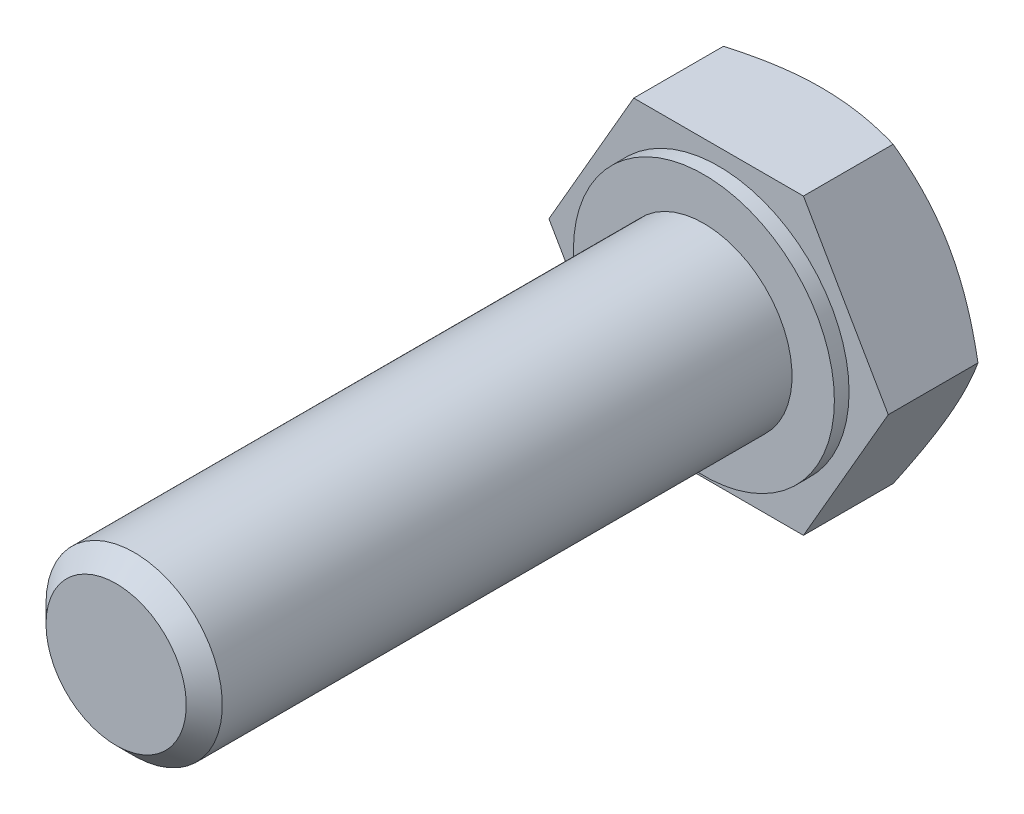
ISO-10303-21;
HEADER;
FILE_DESCRIPTION(('STEP AP214'),'2;1');
FILE_NAME('part.step','',(''),(''),'','','');
FILE_SCHEMA(('AUTOMOTIVE_DESIGN { 1 0 10303 214 1 1 1 1 }'));
ENDSEC;
DATA;
#1=APPLICATION_CONTEXT('core data for automotive mechanical design processes');
#2=APPLICATION_PROTOCOL_DEFINITION('international standard','automotive_design',2000,#1);
#3=PRODUCT_CONTEXT('',#1,'mechanical');
#4=PRODUCT('Part','Part','',(#3));
#5=PRODUCT_RELATED_PRODUCT_CATEGORY('part','',(#4));
#6=PRODUCT_DEFINITION_FORMATION('','',#4);
#7=PRODUCT_DEFINITION_CONTEXT('part definition',#1,'design');
#8=PRODUCT_DEFINITION('design','',#6,#7);
#9=PRODUCT_DEFINITION_SHAPE('','',#8);
#10=(LENGTH_UNIT() NAMED_UNIT(*) SI_UNIT(.MILLI.,.METRE.));
#11=(NAMED_UNIT(*) PLANE_ANGLE_UNIT() SI_UNIT($,.RADIAN.));
#12=(NAMED_UNIT(*) SI_UNIT($,.STERADIAN.) SOLID_ANGLE_UNIT());
#13=UNCERTAINTY_MEASURE_WITH_UNIT(LENGTH_MEASURE(1.E-05),#10,'distance_accuracy_value','');
#14=(GEOMETRIC_REPRESENTATION_CONTEXT(3) GLOBAL_UNCERTAINTY_ASSIGNED_CONTEXT((#13)) GLOBAL_UNIT_ASSIGNED_CONTEXT((#10,
#11,#12)) REPRESENTATION_CONTEXT('',''));
#15=CARTESIAN_POINT('',(0.,0.,0.));
#16=DIRECTION('',(0.,0.,1.));
#17=DIRECTION('',(1.,0.,0.));
#18=AXIS2_PLACEMENT_3D('',#15,#16,#17);
#19=CARTESIAN_POINT('',(-3.2737481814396,-0.877198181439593,10.5));
#20=DIRECTION('',(0.,0.,1.));
#21=DIRECTION('',(0.866025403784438,-0.500000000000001,0.));
#22=AXIS2_PLACEMENT_3D('',#19,#20,#21);
#23=PLANE('',#22);
#24=CARTESIAN_POINT('',(0.,0.,10.5));
#25=DIRECTION('',(0.,0.,-1.));
#26=DIRECTION('',(-1.,0.,0.));
#27=AXIS2_PLACEMENT_3D('',#24,#25,#26);
#28=CIRCLE('',#27,2.38655);
#29=CARTESIAN_POINT('',(-2.38654999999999,0.,10.5));
#30=VERTEX_POINT('',#29);
#31=EDGE_CURVE('E20',#30,#30,#28,.T.);
#32=ORIENTED_EDGE('',*,*,#31,.F.);
#33=EDGE_LOOP('',(#32));
#34=FACE_BOUND('',#33,.T.);
#35=ADVANCED_FACE('F16',(#34),#23,.T.);
#36=CARTESIAN_POINT('',(1.44703592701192,-7.51366025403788,-13.5001));
#37=DIRECTION('',(0.,0.,-1.));
#38=DIRECTION('',(-0.866025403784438,0.5,0.));
#39=AXIS2_PLACEMENT_3D('',#36,#37,#38);
#40=PLANE('',#39);
#41=CARTESIAN_POINT('',(0.,0.,-13.5001));
#42=DIRECTION('',(0.,0.,1.));
#43=DIRECTION('',(1.,0.,0.));
#44=AXIS2_PLACEMENT_3D('',#41,#42,#43);
#45=CIRCLE('',#44,5.);
#46=CARTESIAN_POINT('',(-4.33012701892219,-2.5,-13.5001));
#47=VERTEX_POINT('',#46);
#48=CARTESIAN_POINT('',(0.,-5.,-13.5001));
#49=VERTEX_POINT('',#48);
#50=EDGE_CURVE('E93',#47,#49,#45,.T.);
#51=ORIENTED_EDGE('',*,*,#50,.F.);
#52=CARTESIAN_POINT('',(0.,0.,-13.5001));
#53=DIRECTION('',(0.,0.,1.));
#54=DIRECTION('',(1.,0.,0.));
#55=AXIS2_PLACEMENT_3D('',#52,#53,#54);
#56=CIRCLE('',#55,5.00000000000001);
#57=CARTESIAN_POINT('',(-4.33012701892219,2.50000000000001,-13.5001));
#58=VERTEX_POINT('',#57);
#59=EDGE_CURVE('E89',#58,#47,#56,.T.);
#60=ORIENTED_EDGE('',*,*,#59,.F.);
#61=CARTESIAN_POINT('',(0.,0.,-13.5001));
#62=DIRECTION('',(0.,0.,1.));
#63=DIRECTION('',(1.,0.,0.));
#64=AXIS2_PLACEMENT_3D('',#61,#62,#63);
#65=CIRCLE('',#64,5.);
#66=CARTESIAN_POINT('',(0.,5.,-13.5001));
#67=VERTEX_POINT('',#66);
#68=EDGE_CURVE('E86',#67,#58,#65,.T.);
#69=ORIENTED_EDGE('',*,*,#68,.F.);
#70=CARTESIAN_POINT('',(0.,0.,-13.5001));
#71=DIRECTION('',(0.,0.,1.));
#72=DIRECTION('',(1.,0.,0.));
#73=AXIS2_PLACEMENT_3D('',#70,#71,#72);
#74=CIRCLE('',#73,5.);
#75=CARTESIAN_POINT('',(4.33012701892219,2.5,-13.5001));
#76=VERTEX_POINT('',#75);
#77=EDGE_CURVE('E322',#76,#67,#74,.T.);
#78=ORIENTED_EDGE('',*,*,#77,.F.);
#79=CARTESIAN_POINT('',(0.,0.,-13.5001));
#80=DIRECTION('',(0.,0.,1.));
#81=DIRECTION('',(1.,0.,0.));
#82=AXIS2_PLACEMENT_3D('',#79,#80,#81);
#83=CIRCLE('',#82,4.99999999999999);
#84=CARTESIAN_POINT('',(4.3301270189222,-2.5,-13.5001));
#85=VERTEX_POINT('',#84);
#86=EDGE_CURVE('E319',#85,#76,#83,.T.);
#87=ORIENTED_EDGE('',*,*,#86,.F.);
#88=CARTESIAN_POINT('',(0.,0.,-13.5001));
#89=DIRECTION('',(0.,0.,1.));
#90=DIRECTION('',(1.,0.,0.));
#91=AXIS2_PLACEMENT_3D('',#88,#89,#90);
#92=CIRCLE('',#91,5.00000000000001);
#93=EDGE_CURVE('E309',#49,#85,#92,.T.);
#94=ORIENTED_EDGE('',*,*,#93,.F.);
#95=EDGE_LOOP('',(#51,#60,#69,#78,#87,#94));
#96=FACE_BOUND('',#95,.T.);
#97=ADVANCED_FACE('F91',(#96),#40,.T.);
#98=CARTESIAN_POINT('',(0.,0.,9.88644999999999));
#99=DIRECTION('',(0.,0.,-1.));
#100=DIRECTION('',(-1.,0.,0.));
#101=AXIS2_PLACEMENT_3D('',#98,#99,#100);
#102=CONICAL_SURFACE('',#101,3.00000000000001,0.78531666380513);
#103=ORIENTED_EDGE('',*,*,#31,.T.);
#104=EDGE_LOOP('',(#103));
#105=FACE_BOUND('',#104,.T.);
#106=CARTESIAN_POINT('',(0.,0.,9.88644999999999));
#107=DIRECTION('',(0.,0.,-1.));
#108=DIRECTION('',(-1.,0.,0.));
#109=AXIS2_PLACEMENT_3D('',#106,#107,#108);
#110=CIRCLE('',#109,3.);
#111=CARTESIAN_POINT('',(-3.,0.,9.88644999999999));
#112=VERTEX_POINT('',#111);
#113=EDGE_CURVE('E238',#112,#112,#110,.T.);
#114=ORIENTED_EDGE('',*,*,#113,.F.);
#115=EDGE_LOOP('',(#114));
#116=FACE_BOUND('',#115,.T.);
#117=ADVANCED_FACE('F146',(#105,#116),#102,.T.);
#118=CARTESIAN_POINT('',(0.,0.,-13.0535180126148));
#119=DIRECTION('',(0.,0.,1.));
#120=DIRECTION('',(1.,0.,0.));
#121=AXIS2_PLACEMENT_3D('',#118,#119,#120);
#122=CONICAL_SURFACE('',#121,5.77350269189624,1.04719755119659);
#123=ORIENTED_EDGE('',*,*,#68,.T.);
#124=CARTESIAN_POINT('',(-2.88675134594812,4.99999999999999,-13.0535180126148));
#125=CARTESIAN_POINT('',(-3.00424151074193,4.79650106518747,-13.1213680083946));
#126=CARTESIAN_POINT('',(-3.12267257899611,4.59137243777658,-13.1835304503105));
#127=CARTESIAN_POINT('',(-3.36057867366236,4.17930699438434,-13.2931527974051));
#128=CARTESIAN_POINT('',(-3.48004540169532,3.97238455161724,-13.3406854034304));
#129=CARTESIAN_POINT('',(-3.66037296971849,3.66004804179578,-13.3990473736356));
#130=CARTESIAN_POINT('',(-3.72070995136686,3.55554132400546,-13.4163522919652));
#131=CARTESIAN_POINT('',(-3.84167277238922,3.34602757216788,-13.4463074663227));
#132=CARTESIAN_POINT('',(-3.9022986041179,3.24102055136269,-13.4589578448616));
#133=CARTESIAN_POINT('',(-4.02406337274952,3.03011778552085,-13.4793816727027));
#134=CARTESIAN_POINT('',(-4.08520335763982,2.92422022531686,-13.4871303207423));
#135=CARTESIAN_POINT('',(-4.20760356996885,2.71221683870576,-13.4975002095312));
#136=CARTESIAN_POINT('',(-4.26886381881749,2.6061109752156,-13.5001204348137));
#137=CARTESIAN_POINT('',(-4.33012701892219,2.5,-13.5001));
#138=B_SPLINE_CURVE_WITH_KNOTS('',3,(#124,#125,#126,#127,#128,#129,#130,#131,#132,#133,#134,
#135,#136,#137),.UNSPECIFIED.,.F.,.F.,(4,2,2,2,2,2,4),(0.,0.734036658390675,1.46436443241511,
1.83000749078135,2.19564092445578,2.56310985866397,2.93065154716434),.UNSPECIFIED.);
#139=CARTESIAN_POINT('',(-2.88675134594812,5.,-13.0535180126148));
#140=VERTEX_POINT('',#139);
#141=EDGE_CURVE('E112',#140,#58,#138,.T.);
#142=ORIENTED_EDGE('',*,*,#141,.F.);
#143=CARTESIAN_POINT('',(0.,5.,-13.5001));
#144=CARTESIAN_POINT('',(-0.1225264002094,5.,-13.5001204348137));
#145=CARTESIAN_POINT('',(-0.245046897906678,5.,-13.4975002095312));
#146=CARTESIAN_POINT('',(-0.489847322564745,5.,-13.4871303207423));
#147=CARTESIAN_POINT('',(-0.612127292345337,5.,-13.4793816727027));
#148=CARTESIAN_POINT('',(-0.85565682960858,5.,-13.4589578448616));
#149=CARTESIAN_POINT('',(-0.97690849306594,5.,-13.4463074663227));
#150=CARTESIAN_POINT('',(-1.21883413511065,5.,-13.4163522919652));
#151=CARTESIAN_POINT('',(-1.33950809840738,5.,-13.3990473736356));
#152=CARTESIAN_POINT('',(-1.70016323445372,5.,-13.3406854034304));
#153=CARTESIAN_POINT('',(-1.93909669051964,5.,-13.2931527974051));
#154=CARTESIAN_POINT('',(-2.41490887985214,5.,-13.1835304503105));
#155=CARTESIAN_POINT('',(-2.65177101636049,5.,-13.1213680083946));
#156=CARTESIAN_POINT('',(-2.88675134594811,5.,-13.0535180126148));
#157=B_SPLINE_CURVE_WITH_KNOTS('',3,(#143,#144,#145,#146,#147,#148,#149,#150,#151,#152,#153,
#154,#155,#156),.UNSPECIFIED.,.F.,.F.,(4,2,2,2,2,2,4),(0.,0.367541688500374,0.735010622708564,
1.10064405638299,1.46628711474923,2.19661488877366,2.93065154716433),.UNSPECIFIED.);
#158=EDGE_CURVE('E106',#67,#140,#157,.T.);
#159=ORIENTED_EDGE('',*,*,#158,.F.);
#160=EDGE_LOOP('',(#123,#142,#159));
#161=FACE_BOUND('',#160,.T.);
#162=ADVANCED_FACE('F111',(#161),#122,.T.);
#163=CARTESIAN_POINT('',(0.,0.,-13.0535180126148));
#164=DIRECTION('',(0.,0.,1.));
#165=DIRECTION('',(1.,0.,0.));
#166=AXIS2_PLACEMENT_3D('',#163,#164,#165);
#167=CONICAL_SURFACE('',#166,5.77350269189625,1.04719755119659);
#168=CARTESIAN_POINT('',(-4.33012701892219,2.5,-13.5001));
#169=CARTESIAN_POINT('',(-4.39139021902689,2.3938890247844,-13.5001204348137));
#170=CARTESIAN_POINT('',(-4.45265046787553,2.28778316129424,-13.4975002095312));
#171=CARTESIAN_POINT('',(-4.57505068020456,2.07577977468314,-13.4871303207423));
#172=CARTESIAN_POINT('',(-4.63619066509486,1.96988221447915,-13.4793816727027));
#173=CARTESIAN_POINT('',(-4.75795543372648,1.75897944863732,-13.4589578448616));
#174=CARTESIAN_POINT('',(-4.81858126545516,1.65397242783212,-13.4463074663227));
#175=CARTESIAN_POINT('',(-4.93954408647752,1.44445867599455,-13.4163522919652));
#176=CARTESIAN_POINT('',(-4.99988106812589,1.33995195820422,-13.3990473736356));
#177=CARTESIAN_POINT('',(-5.18020863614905,1.02761544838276,-13.3406854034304));
#178=CARTESIAN_POINT('',(-5.29967536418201,0.820693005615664,-13.2931527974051));
#179=CARTESIAN_POINT('',(-5.53758145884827,0.408627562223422,-13.1835304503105));
#180=CARTESIAN_POINT('',(-5.65601252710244,0.203498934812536,-13.1213680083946));
#181=CARTESIAN_POINT('',(-5.77350269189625,0.,-13.0535180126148));
#182=B_SPLINE_CURVE_WITH_KNOTS('',3,(#168,#169,#170,#171,#172,#173,#174,#175,#176,#177,#178,
#179,#180,#181),.UNSPECIFIED.,.F.,.F.,(4,2,2,2,2,2,4),(0.,0.367541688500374,0.735010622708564,
1.10064405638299,1.46628711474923,2.19661488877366,2.93065154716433),.UNSPECIFIED.);
#183=CARTESIAN_POINT('',(-5.77350269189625,0.,-13.0535180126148));
#184=VERTEX_POINT('',#183);
#185=EDGE_CURVE('E99',#58,#184,#182,.T.);
#186=ORIENTED_EDGE('',*,*,#185,.F.);
#187=ORIENTED_EDGE('',*,*,#59,.T.);
#188=CARTESIAN_POINT('',(-5.77350269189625,0.,-13.0535180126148));
#189=CARTESIAN_POINT('',(-5.65601252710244,-0.203498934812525,-13.1213680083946));
#190=CARTESIAN_POINT('',(-5.53758145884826,-0.408627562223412,-13.1835304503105));
#191=CARTESIAN_POINT('',(-5.29967536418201,-0.820693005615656,-13.2931527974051));
#192=CARTESIAN_POINT('',(-5.18020863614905,-1.02761544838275,-13.3406854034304));
#193=CARTESIAN_POINT('',(-4.99988106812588,-1.33995195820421,-13.3990473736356));
#194=CARTESIAN_POINT('',(-4.93954408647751,-1.44445867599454,-13.4163522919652));
#195=CARTESIAN_POINT('',(-4.81858126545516,-1.65397242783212,-13.4463074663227));
#196=CARTESIAN_POINT('',(-4.75795543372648,-1.75897944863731,-13.4589578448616));
#197=CARTESIAN_POINT('',(-4.63619066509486,-1.96988221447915,-13.4793816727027));
#198=CARTESIAN_POINT('',(-4.57505068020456,-2.07577977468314,-13.4871303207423));
#199=CARTESIAN_POINT('',(-4.45265046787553,-2.28778316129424,-13.4975002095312));
#200=CARTESIAN_POINT('',(-4.39139021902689,-2.3938890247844,-13.5001204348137));
#201=CARTESIAN_POINT('',(-4.33012701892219,-2.5,-13.5001));
#202=B_SPLINE_CURVE_WITH_KNOTS('',3,(#188,#189,#190,#191,#192,#193,#194,#195,#196,#197,#198,
#199,#200,#201),.UNSPECIFIED.,.F.,.F.,(4,2,2,2,2,2,4),(0.,0.734036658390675,1.46436443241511,
1.83000749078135,2.19564092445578,2.56310985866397,2.93065154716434),.UNSPECIFIED.);
#203=EDGE_CURVE('E101',#184,#47,#202,.T.);
#204=ORIENTED_EDGE('',*,*,#203,.F.);
#205=EDGE_LOOP('',(#186,#187,#204));
#206=FACE_BOUND('',#205,.T.);
#207=ADVANCED_FACE('F100',(#206),#167,.T.);
#208=CARTESIAN_POINT('',(0.,0.,-13.0535180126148));
#209=DIRECTION('',(0.,0.,1.));
#210=DIRECTION('',(1.,0.,0.));
#211=AXIS2_PLACEMENT_3D('',#208,#209,#210);
#212=CONICAL_SURFACE('',#211,5.77350269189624,1.04719755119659);
#213=ORIENTED_EDGE('',*,*,#50,.T.);
#214=CARTESIAN_POINT('',(-2.88675134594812,-5.,-13.0535180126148));
#215=CARTESIAN_POINT('',(-2.6517710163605,-5.,-13.1213680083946));
#216=CARTESIAN_POINT('',(-2.41490887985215,-5.,-13.1835304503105));
#217=CARTESIAN_POINT('',(-1.93909669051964,-5.,-13.2931527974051));
#218=CARTESIAN_POINT('',(-1.70016323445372,-5.,-13.3406854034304));
#219=CARTESIAN_POINT('',(-1.33950809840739,-5.,-13.3990473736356));
#220=CARTESIAN_POINT('',(-1.21883413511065,-5.,-13.4163522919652));
#221=CARTESIAN_POINT('',(-0.976908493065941,-5.,-13.4463074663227));
#222=CARTESIAN_POINT('',(-0.85565682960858,-5.,-13.4589578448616));
#223=CARTESIAN_POINT('',(-0.612127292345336,-5.,-13.4793816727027));
#224=CARTESIAN_POINT('',(-0.489847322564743,-5.,-13.4871303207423));
#225=CARTESIAN_POINT('',(-0.245046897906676,-5.,-13.4975002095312));
#226=CARTESIAN_POINT('',(-0.122526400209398,-5.,-13.5001204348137));
#227=CARTESIAN_POINT('',(0.,-5.,-13.5001));
#228=B_SPLINE_CURVE_WITH_KNOTS('',3,(#214,#215,#216,#217,#218,#219,#220,#221,#222,#223,#224,
#225,#226,#227),.UNSPECIFIED.,.F.,.F.,(4,2,2,2,2,2,4),(0.,0.734036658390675,1.46436443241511,
1.83000749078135,2.19564092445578,2.56310985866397,2.93065154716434),.UNSPECIFIED.);
#229=CARTESIAN_POINT('',(-2.88675134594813,-5.,-13.0535180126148));
#230=VERTEX_POINT('',#229);
#231=EDGE_CURVE('E258',#230,#49,#228,.T.);
#232=ORIENTED_EDGE('',*,*,#231,.F.);
#233=CARTESIAN_POINT('',(-4.33012701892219,-2.5,-13.5001));
#234=CARTESIAN_POINT('',(-4.26886381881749,-2.6061109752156,-13.5001204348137));
#235=CARTESIAN_POINT('',(-4.20760356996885,-2.71221683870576,-13.4975002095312));
#236=CARTESIAN_POINT('',(-4.08520335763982,-2.92422022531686,-13.4871303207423));
#237=CARTESIAN_POINT('',(-4.02406337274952,-3.03011778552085,-13.4793816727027));
#238=CARTESIAN_POINT('',(-3.9022986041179,-3.24102055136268,-13.4589578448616));
#239=CARTESIAN_POINT('',(-3.84167277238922,-3.34602757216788,-13.4463074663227));
#240=CARTESIAN_POINT('',(-3.72070995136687,-3.55554132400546,-13.4163522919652));
#241=CARTESIAN_POINT('',(-3.6603729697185,-3.66004804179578,-13.3990473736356));
#242=CARTESIAN_POINT('',(-3.48004540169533,-3.97238455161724,-13.3406854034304));
#243=CARTESIAN_POINT('',(-3.36057867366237,-4.17930699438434,-13.2931527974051));
#244=CARTESIAN_POINT('',(-3.12267257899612,-4.59137243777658,-13.1835304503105));
#245=CARTESIAN_POINT('',(-3.00424151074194,-4.79650106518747,-13.1213680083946));
#246=CARTESIAN_POINT('',(-2.88675134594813,-4.99999999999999,-13.0535180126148));
#247=B_SPLINE_CURVE_WITH_KNOTS('',3,(#233,#234,#235,#236,#237,#238,#239,#240,#241,#242,#243,
#244,#245,#246),.UNSPECIFIED.,.F.,.F.,(4,2,2,2,2,2,4),(0.,0.367541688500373,0.735010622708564,
1.10064405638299,1.46628711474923,2.19661488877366,2.93065154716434),.UNSPECIFIED.);
#248=EDGE_CURVE('E117',#47,#230,#247,.T.);
#249=ORIENTED_EDGE('',*,*,#248,.F.);
#250=EDGE_LOOP('',(#213,#232,#249));
#251=FACE_BOUND('',#250,.T.);
#252=ADVANCED_FACE('F293',(#251),#212,.T.);
#253=CARTESIAN_POINT('',(0.,0.,-13.0535180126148));
#254=DIRECTION('',(0.,0.,1.));
#255=DIRECTION('',(1.,0.,0.));
#256=AXIS2_PLACEMENT_3D('',#253,#254,#255);
#257=CONICAL_SURFACE('',#256,5.77350269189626,1.0471975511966);
#258=CARTESIAN_POINT('',(0.,-5.,-13.5001));
#259=CARTESIAN_POINT('',(0.122526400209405,-5.,-13.5001204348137));
#260=CARTESIAN_POINT('',(0.245046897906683,-5.,-13.4975002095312));
#261=CARTESIAN_POINT('',(0.489847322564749,-5.,-13.4871303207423));
#262=CARTESIAN_POINT('',(0.612127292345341,-5.,-13.4793816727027));
#263=CARTESIAN_POINT('',(0.855656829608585,-5.,-13.4589578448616));
#264=CARTESIAN_POINT('',(0.976908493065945,-5.,-13.4463074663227));
#265=CARTESIAN_POINT('',(1.21883413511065,-5.,-13.4163522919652));
#266=CARTESIAN_POINT('',(1.33950809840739,-5.,-13.3990473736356));
#267=CARTESIAN_POINT('',(1.70016323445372,-5.,-13.3406854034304));
#268=CARTESIAN_POINT('',(1.93909669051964,-5.,-13.2931527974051));
#269=CARTESIAN_POINT('',(2.41490887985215,-5.,-13.1835304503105));
#270=CARTESIAN_POINT('',(2.6517710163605,-5.,-13.1213680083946));
#271=CARTESIAN_POINT('',(2.88675134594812,-5.,-13.0535180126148));
#272=B_SPLINE_CURVE_WITH_KNOTS('',3,(#258,#259,#260,#261,#262,#263,#264,#265,#266,#267,#268,
#269,#270,#271),.UNSPECIFIED.,.F.,.F.,(4,2,2,2,2,2,4),(0.,0.367541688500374,0.735010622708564,
1.10064405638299,1.46628711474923,2.19661488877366,2.93065154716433),.UNSPECIFIED.);
#273=CARTESIAN_POINT('',(2.88675134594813,-5.,-13.0535180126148));
#274=VERTEX_POINT('',#273);
#275=EDGE_CURVE('E259',#49,#274,#272,.T.);
#276=ORIENTED_EDGE('',*,*,#275,.F.);
#277=ORIENTED_EDGE('',*,*,#93,.T.);
#278=CARTESIAN_POINT('',(2.88675134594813,-4.99999999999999,-13.0535180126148));
#279=CARTESIAN_POINT('',(3.00424151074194,-4.79650106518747,-13.1213680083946));
#280=CARTESIAN_POINT('',(3.12267257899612,-4.59137243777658,-13.1835304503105));
#281=CARTESIAN_POINT('',(3.36057867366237,-4.17930699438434,-13.2931527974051));
#282=CARTESIAN_POINT('',(3.48004540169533,-3.97238455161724,-13.3406854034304));
#283=CARTESIAN_POINT('',(3.6603729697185,-3.66004804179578,-13.3990473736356));
#284=CARTESIAN_POINT('',(3.72070995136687,-3.55554132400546,-13.4163522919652));
#285=CARTESIAN_POINT('',(3.84167277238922,-3.34602757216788,-13.4463074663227));
#286=CARTESIAN_POINT('',(3.9022986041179,-3.24102055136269,-13.4589578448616));
#287=CARTESIAN_POINT('',(4.02406337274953,-3.03011778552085,-13.4793816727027));
#288=CARTESIAN_POINT('',(4.08520335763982,-2.92422022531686,-13.4871303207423));
#289=CARTESIAN_POINT('',(4.20760356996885,-2.71221683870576,-13.4975002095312));
#290=CARTESIAN_POINT('',(4.26886381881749,-2.6061109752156,-13.5001204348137));
#291=CARTESIAN_POINT('',(4.33012701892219,-2.5,-13.5001));
#292=B_SPLINE_CURVE_WITH_KNOTS('',3,(#278,#279,#280,#281,#282,#283,#284,#285,#286,#287,#288,
#289,#290,#291),.UNSPECIFIED.,.F.,.F.,(4,2,2,2,2,2,4),(0.,0.734036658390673,1.46436443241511,
1.83000749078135,2.19564092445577,2.56310985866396,2.93065154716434),.UNSPECIFIED.);
#293=EDGE_CURVE('E288',#274,#85,#292,.T.);
#294=ORIENTED_EDGE('',*,*,#293,.F.);
#295=EDGE_LOOP('',(#276,#277,#294));
#296=FACE_BOUND('',#295,.T.);
#297=ADVANCED_FACE('F296',(#296),#257,.T.);
#298=CARTESIAN_POINT('',(0.,0.,-13.0535180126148));
#299=DIRECTION('',(0.,0.,1.));
#300=DIRECTION('',(1.,0.,0.));
#301=AXIS2_PLACEMENT_3D('',#298,#299,#300);
#302=CONICAL_SURFACE('',#301,5.77350269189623,1.04719755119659);
#303=ORIENTED_EDGE('',*,*,#86,.T.);
#304=CARTESIAN_POINT('',(5.77350269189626,0.,-13.0535180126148));
#305=CARTESIAN_POINT('',(5.65601252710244,0.203498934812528,-13.1213680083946));
#306=CARTESIAN_POINT('',(5.53758145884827,0.408627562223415,-13.1835304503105));
#307=CARTESIAN_POINT('',(5.29967536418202,0.820693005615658,-13.2931527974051));
#308=CARTESIAN_POINT('',(5.18020863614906,1.02761544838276,-13.3406854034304));
#309=CARTESIAN_POINT('',(4.99988106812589,1.33995195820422,-13.3990473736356));
#310=CARTESIAN_POINT('',(4.93954408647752,1.44445867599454,-13.4163522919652));
#311=CARTESIAN_POINT('',(4.81858126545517,1.65397242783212,-13.4463074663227));
#312=CARTESIAN_POINT('',(4.75795543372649,1.75897944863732,-13.4589578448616));
#313=CARTESIAN_POINT('',(4.63619066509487,1.96988221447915,-13.4793816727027));
#314=CARTESIAN_POINT('',(4.57505068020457,2.07577977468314,-13.4871303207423));
#315=CARTESIAN_POINT('',(4.45265046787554,2.28778316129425,-13.4975002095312));
#316=CARTESIAN_POINT('',(4.3913902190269,2.3938890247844,-13.5001204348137));
#317=CARTESIAN_POINT('',(4.3301270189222,2.5,-13.5001));
#318=B_SPLINE_CURVE_WITH_KNOTS('',3,(#304,#305,#306,#307,#308,#309,#310,#311,#312,#313,#314,
#315,#316,#317),.UNSPECIFIED.,.F.,.F.,(4,2,2,2,2,2,4),(0.,0.734036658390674,1.46436443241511,
1.83000749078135,2.19564092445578,2.56310985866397,2.93065154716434),.UNSPECIFIED.);
#319=CARTESIAN_POINT('',(5.77350269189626,0.,-13.0535180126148));
#320=VERTEX_POINT('',#319);
#321=EDGE_CURVE('E191',#320,#76,#318,.T.);
#322=ORIENTED_EDGE('',*,*,#321,.F.);
#323=CARTESIAN_POINT('',(4.33012701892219,-2.5,-13.5001));
#324=CARTESIAN_POINT('',(4.3913902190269,-2.3938890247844,-13.5001204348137));
#325=CARTESIAN_POINT('',(4.45265046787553,-2.28778316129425,-13.4975002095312));
#326=CARTESIAN_POINT('',(4.57505068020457,-2.07577977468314,-13.4871303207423));
#327=CARTESIAN_POINT('',(4.63619066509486,-1.96988221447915,-13.4793816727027));
#328=CARTESIAN_POINT('',(4.75795543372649,-1.75897944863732,-13.4589578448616));
#329=CARTESIAN_POINT('',(4.81858126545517,-1.65397242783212,-13.4463074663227));
#330=CARTESIAN_POINT('',(4.93954408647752,-1.44445867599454,-13.4163522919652));
#331=CARTESIAN_POINT('',(4.99988106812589,-1.33995195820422,-13.3990473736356));
#332=CARTESIAN_POINT('',(5.18020863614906,-1.02761544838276,-13.3406854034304));
#333=CARTESIAN_POINT('',(5.29967536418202,-0.820693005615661,-13.2931527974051));
#334=CARTESIAN_POINT('',(5.53758145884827,-0.408627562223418,-13.1835304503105));
#335=CARTESIAN_POINT('',(5.65601252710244,-0.203498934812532,-13.1213680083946));
#336=CARTESIAN_POINT('',(5.77350269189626,0.,-13.0535180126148));
#337=B_SPLINE_CURVE_WITH_KNOTS('',3,(#323,#324,#325,#326,#327,#328,#329,#330,#331,#332,#333,
#334,#335,#336),.UNSPECIFIED.,.F.,.F.,(4,2,2,2,2,2,4),(0.,0.367541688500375,0.735010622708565,
1.10064405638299,1.46628711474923,2.19661488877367,2.93065154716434),.UNSPECIFIED.);
#338=EDGE_CURVE('E254',#85,#320,#337,.T.);
#339=ORIENTED_EDGE('',*,*,#338,.F.);
#340=EDGE_LOOP('',(#303,#322,#339));
#341=FACE_BOUND('',#340,.T.);
#342=ADVANCED_FACE('F175',(#341),#302,.T.);
#343=CARTESIAN_POINT('',(0.,0.,-13.0535180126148));
#344=DIRECTION('',(0.,0.,1.));
#345=DIRECTION('',(1.,0.,0.));
#346=AXIS2_PLACEMENT_3D('',#343,#344,#345);
#347=CONICAL_SURFACE('',#346,5.77350269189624,1.0471975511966);
#348=CARTESIAN_POINT('',(2.88675134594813,5.,-13.0535180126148));
#349=CARTESIAN_POINT('',(2.6517710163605,5.,-13.1213680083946));
#350=CARTESIAN_POINT('',(2.41490887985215,5.,-13.1835304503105));
#351=CARTESIAN_POINT('',(1.93909669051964,5.,-13.2931527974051));
#352=CARTESIAN_POINT('',(1.70016323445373,5.,-13.3406854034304));
#353=CARTESIAN_POINT('',(1.33950809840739,5.,-13.3990473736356));
#354=CARTESIAN_POINT('',(1.21883413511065,5.,-13.4163522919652));
#355=CARTESIAN_POINT('',(0.976908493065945,5.,-13.4463074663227));
#356=CARTESIAN_POINT('',(0.855656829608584,5.,-13.4589578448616));
#357=CARTESIAN_POINT('',(0.61212729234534,5.,-13.4793816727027));
#358=CARTESIAN_POINT('',(0.489847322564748,5.,-13.4871303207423));
#359=CARTESIAN_POINT('',(0.24504689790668,5.,-13.4975002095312));
#360=CARTESIAN_POINT('',(0.122526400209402,5.,-13.5001204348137));
#361=CARTESIAN_POINT('',(0.,5.,-13.5001));
#362=B_SPLINE_CURVE_WITH_KNOTS('',3,(#348,#349,#350,#351,#352,#353,#354,#355,#356,#357,#358,
#359,#360,#361),.UNSPECIFIED.,.F.,.F.,(4,2,2,2,2,2,4),(0.,0.734036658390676,1.46436443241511,
1.83000749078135,2.19564092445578,2.56310985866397,2.93065154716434),.UNSPECIFIED.);
#363=CARTESIAN_POINT('',(2.88675134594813,5.,-13.0535180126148));
#364=VERTEX_POINT('',#363);
#365=EDGE_CURVE('E155',#364,#67,#362,.T.);
#366=ORIENTED_EDGE('',*,*,#365,.F.);
#367=CARTESIAN_POINT('',(4.3301270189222,2.5,-13.5001));
#368=CARTESIAN_POINT('',(4.2688638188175,2.6061109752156,-13.5001204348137));
#369=CARTESIAN_POINT('',(4.20760356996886,2.71221683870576,-13.4975002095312));
#370=CARTESIAN_POINT('',(4.08520335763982,2.92422022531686,-13.4871303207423));
#371=CARTESIAN_POINT('',(4.02406337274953,3.03011778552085,-13.4793816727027));
#372=CARTESIAN_POINT('',(3.90229860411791,3.24102055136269,-13.4589578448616));
#373=CARTESIAN_POINT('',(3.84167277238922,3.34602757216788,-13.4463074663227));
#374=CARTESIAN_POINT('',(3.72070995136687,3.55554132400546,-13.4163522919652));
#375=CARTESIAN_POINT('',(3.6603729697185,3.66004804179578,-13.3990473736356));
#376=CARTESIAN_POINT('',(3.48004540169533,3.97238455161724,-13.3406854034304));
#377=CARTESIAN_POINT('',(3.36057867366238,4.17930699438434,-13.2931527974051));
#378=CARTESIAN_POINT('',(3.12267257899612,4.59137243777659,-13.1835304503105));
#379=CARTESIAN_POINT('',(3.00424151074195,4.79650106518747,-13.1213680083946));
#380=CARTESIAN_POINT('',(2.88675134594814,4.99999999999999,-13.0535180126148));
#381=B_SPLINE_CURVE_WITH_KNOTS('',3,(#367,#368,#369,#370,#371,#372,#373,#374,#375,#376,#377,
#378,#379,#380),.UNSPECIFIED.,.F.,.F.,(4,2,2,2,2,2,4),(0.,0.367541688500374,0.735010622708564,
1.10064405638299,1.46628711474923,2.19661488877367,2.93065154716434),.UNSPECIFIED.);
#382=EDGE_CURVE('E181',#76,#364,#381,.T.);
#383=ORIENTED_EDGE('',*,*,#382,.F.);
#384=ORIENTED_EDGE('',*,*,#77,.T.);
#385=EDGE_LOOP('',(#366,#383,#384));
#386=FACE_BOUND('',#385,.T.);
#387=ADVANCED_FACE('F170',(#386),#347,.T.);
#388=CARTESIAN_POINT('',(0.,0.,9.88644999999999));
#389=DIRECTION('',(0.,0.,-1.));
#390=DIRECTION('',(-1.,0.,0.));
#391=AXIS2_PLACEMENT_3D('',#388,#389,#390);
#392=CYLINDRICAL_SURFACE('',#391,3.);
#393=CARTESIAN_POINT('',(0.,0.,-9.5));
#394=DIRECTION('',(0.,0.,-1.));
#395=DIRECTION('',(-1.,0.,0.));
#396=AXIS2_PLACEMENT_3D('',#393,#394,#395);
#397=CIRCLE('',#396,3.);
#398=CARTESIAN_POINT('',(-3.,0.,-9.5));
#399=VERTEX_POINT('',#398);
#400=EDGE_CURVE('E192',#399,#399,#397,.T.);
#401=ORIENTED_EDGE('',*,*,#400,.F.);
#402=EDGE_LOOP('',(#401));
#403=FACE_BOUND('',#402,.T.);
#404=ORIENTED_EDGE('',*,*,#113,.T.);
#405=EDGE_LOOP('',(#404));
#406=FACE_BOUND('',#405,.T.);
#407=ADVANCED_FACE('F166',(#403,#406),#392,.T.);
#408=CARTESIAN_POINT('',(-2.89675134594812,5.,-13.5101));
#409=DIRECTION('',(0.,1.,0.));
#410=DIRECTION('',(0.,0.,1.));
#411=AXIS2_PLACEMENT_3D('',#408,#409,#410);
#412=PLANE('',#411);
#413=DIRECTION('',(-1.,0.,0.));
#414=VECTOR('',#413,1.);
#415=CARTESIAN_POINT('',(2.88675134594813,5.,-10.0001));
#416=LINE('',#415,#414);
#417=CARTESIAN_POINT('',(2.88675134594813,5.,-10.0001));
#418=VERTEX_POINT('',#417);
#419=CARTESIAN_POINT('',(-2.88675134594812,5.,-10.0001));
#420=VERTEX_POINT('',#419);
#421=EDGE_CURVE('E241',#418,#420,#416,.T.);
#422=ORIENTED_EDGE('',*,*,#421,.F.);
#423=DIRECTION('',(0.,0.,1.));
#424=VECTOR('',#423,1.);
#425=CARTESIAN_POINT('',(2.88675134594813,5.,-11.7501));
#426=LINE('',#425,#424);
#427=EDGE_CURVE('E190',#364,#418,#426,.T.);
#428=ORIENTED_EDGE('',*,*,#427,.F.);
#429=ORIENTED_EDGE('',*,*,#365,.T.);
#430=ORIENTED_EDGE('',*,*,#158,.T.);
#431=DIRECTION('',(0.,0.,-1.));
#432=VECTOR('',#431,1.);
#433=CARTESIAN_POINT('',(-2.88675134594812,5.,-11.7501));
#434=LINE('',#433,#432);
#435=EDGE_CURVE('E105',#420,#140,#434,.T.);
#436=ORIENTED_EDGE('',*,*,#435,.F.);
#437=EDGE_LOOP('',(#422,#428,#429,#430,#436));
#438=FACE_BOUND('',#437,.T.);
#439=ADVANCED_FACE('F162',(#438),#412,.T.);
#440=CARTESIAN_POINT('',(-5.77850269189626,-0.00866025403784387,-13.5101));
#441=DIRECTION('',(-0.866025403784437,0.500000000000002,0.));
#442=DIRECTION('',(0.,0.,1.));
#443=AXIS2_PLACEMENT_3D('',#440,#441,#442);
#444=PLANE('',#443);
#445=ORIENTED_EDGE('',*,*,#435,.T.);
#446=ORIENTED_EDGE('',*,*,#141,.T.);
#447=ORIENTED_EDGE('',*,*,#185,.T.);
#448=DIRECTION('',(0.,0.,-1.));
#449=VECTOR('',#448,1.);
#450=CARTESIAN_POINT('',(-5.77350269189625,0.,-11.7501));
#451=LINE('',#450,#449);
#452=CARTESIAN_POINT('',(-5.77350269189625,0.,-10.0001));
#453=VERTEX_POINT('',#452);
#454=EDGE_CURVE('E119',#453,#184,#451,.T.);
#455=ORIENTED_EDGE('',*,*,#454,.F.);
#456=DIRECTION('',(-0.5,-0.866025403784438,0.));
#457=VECTOR('',#456,1.);
#458=CARTESIAN_POINT('',(-4.33012701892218,2.5,-10.0001));
#459=LINE('',#458,#457);
#460=EDGE_CURVE('E239',#420,#453,#459,.T.);
#461=ORIENTED_EDGE('',*,*,#460,.F.);
#462=EDGE_LOOP('',(#445,#446,#447,#455,#461));
#463=FACE_BOUND('',#462,.T.);
#464=ADVANCED_FACE('F115',(#463),#444,.T.);
#465=CARTESIAN_POINT('',(-5.77850269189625,0.0086602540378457,-13.5101));
#466=DIRECTION('',(-0.866025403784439,-0.499999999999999,0.));
#467=DIRECTION('',(0.499999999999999,-0.866025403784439,0.));
#468=AXIS2_PLACEMENT_3D('',#465,#466,#467);
#469=PLANE('',#468);
#470=ORIENTED_EDGE('',*,*,#454,.T.);
#471=ORIENTED_EDGE('',*,*,#203,.T.);
#472=ORIENTED_EDGE('',*,*,#248,.T.);
#473=DIRECTION('',(0.,0.,-1.));
#474=VECTOR('',#473,1.);
#475=CARTESIAN_POINT('',(-2.88675134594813,-5.,-11.7501));
#476=LINE('',#475,#474);
#477=CARTESIAN_POINT('',(-2.88675134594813,-5.,-10.0001));
#478=VERTEX_POINT('',#477);
#479=EDGE_CURVE('E255',#478,#230,#476,.T.);
#480=ORIENTED_EDGE('',*,*,#479,.F.);
#481=DIRECTION('',(0.5,-0.866025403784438,0.));
#482=VECTOR('',#481,1.);
#483=CARTESIAN_POINT('',(-5.77350269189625,0.,-10.0001));
#484=LINE('',#483,#482);
#485=EDGE_CURVE('E234',#453,#478,#484,.T.);
#486=ORIENTED_EDGE('',*,*,#485,.F.);
#487=EDGE_LOOP('',(#470,#471,#472,#480,#486));
#488=FACE_BOUND('',#487,.T.);
#489=ADVANCED_FACE('F273',(#488),#469,.T.);
#490=CARTESIAN_POINT('',(-2.89675134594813,-5.,-9.9901));
#491=DIRECTION('',(0.,-1.,0.));
#492=DIRECTION('',(0.,0.,-1.));
#493=AXIS2_PLACEMENT_3D('',#490,#491,#492);
#494=PLANE('',#493);
#495=ORIENTED_EDGE('',*,*,#479,.T.);
#496=ORIENTED_EDGE('',*,*,#231,.T.);
#497=ORIENTED_EDGE('',*,*,#275,.T.);
#498=DIRECTION('',(0.,0.,-1.));
#499=VECTOR('',#498,1.);
#500=CARTESIAN_POINT('',(2.88675134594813,-5.,-11.7501));
#501=LINE('',#500,#499);
#502=CARTESIAN_POINT('',(2.88675134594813,-5.,-10.0001));
#503=VERTEX_POINT('',#502);
#504=EDGE_CURVE('E252',#503,#274,#501,.T.);
#505=ORIENTED_EDGE('',*,*,#504,.F.);
#506=DIRECTION('',(1.,0.,0.));
#507=VECTOR('',#506,1.);
#508=CARTESIAN_POINT('',(-2.88675134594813,-5.,-10.0001));
#509=LINE('',#508,#507);
#510=EDGE_CURVE('E230',#478,#503,#509,.T.);
#511=ORIENTED_EDGE('',*,*,#510,.F.);
#512=EDGE_LOOP('',(#495,#496,#497,#505,#511));
#513=FACE_BOUND('',#512,.T.);
#514=ADVANCED_FACE('F276',(#513),#494,.T.);
#515=CARTESIAN_POINT('',(2.88175134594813,-5.00866025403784,-9.9901));
#516=DIRECTION('',(0.866025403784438,-0.500000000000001,0.));
#517=DIRECTION('',(0.,0.,-1.));
#518=AXIS2_PLACEMENT_3D('',#515,#516,#517);
#519=PLANE('',#518);
#520=DIRECTION('',(0.5,0.866025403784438,0.));
#521=VECTOR('',#520,1.);
#522=CARTESIAN_POINT('',(4.3301270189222,-2.5,-10.0001));
#523=LINE('',#522,#521);
#524=CARTESIAN_POINT('',(5.77350269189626,0.,-10.0001));
#525=VERTEX_POINT('',#524);
#526=EDGE_CURVE('E225',#503,#525,#523,.T.);
#527=ORIENTED_EDGE('',*,*,#526,.F.);
#528=ORIENTED_EDGE('',*,*,#504,.T.);
#529=ORIENTED_EDGE('',*,*,#293,.T.);
#530=ORIENTED_EDGE('',*,*,#338,.T.);
#531=DIRECTION('',(0.,0.,-1.));
#532=VECTOR('',#531,1.);
#533=CARTESIAN_POINT('',(5.77350269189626,0.,-11.7501));
#534=LINE('',#533,#532);
#535=EDGE_CURVE('E35',#525,#320,#534,.T.);
#536=ORIENTED_EDGE('',*,*,#535,.F.);
#537=EDGE_LOOP('',(#527,#528,#529,#530,#536));
#538=FACE_BOUND('',#537,.T.);
#539=ADVANCED_FACE('F205',(#538),#519,.T.);
#540=CARTESIAN_POINT('',(5.77850269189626,-0.00866025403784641,-13.5101));
#541=DIRECTION('',(0.866025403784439,0.5,0.));
#542=DIRECTION('',(-0.5,0.866025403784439,0.));
#543=AXIS2_PLACEMENT_3D('',#540,#541,#542);
#544=PLANE('',#543);
#545=DIRECTION('',(-0.5,0.866025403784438,0.));
#546=VECTOR('',#545,1.);
#547=CARTESIAN_POINT('',(5.77350269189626,0.,-10.0001));
#548=LINE('',#547,#546);
#549=EDGE_CURVE('E227',#525,#418,#548,.T.);
#550=ORIENTED_EDGE('',*,*,#549,.F.);
#551=ORIENTED_EDGE('',*,*,#535,.T.);
#552=ORIENTED_EDGE('',*,*,#321,.T.);
#553=ORIENTED_EDGE('',*,*,#382,.T.);
#554=ORIENTED_EDGE('',*,*,#427,.T.);
#555=EDGE_LOOP('',(#550,#551,#552,#553,#554));
#556=FACE_BOUND('',#555,.T.);
#557=ADVANCED_FACE('F199',(#556),#544,.T.);
#558=CARTESIAN_POINT('',(-6.07881304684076,-1.62881304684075,-9.5));
#559=DIRECTION('',(0.,0.,1.));
#560=DIRECTION('',(0.866025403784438,-0.5,0.));
#561=AXIS2_PLACEMENT_3D('',#558,#559,#560);
#562=PLANE('',#561);
#563=ORIENTED_EDGE('',*,*,#400,.T.);
#564=EDGE_LOOP('',(#563));
#565=FACE_BOUND('',#564,.T.);
#566=CARTESIAN_POINT('',(0.,0.,-9.5));
#567=DIRECTION('',(0.,0.,-1.));
#568=DIRECTION('',(-1.,0.,0.));
#569=AXIS2_PLACEMENT_3D('',#566,#567,#568);
#570=CIRCLE('',#569,4.44);
#571=CARTESIAN_POINT('',(-4.44,0.,-9.5));
#572=VERTEX_POINT('',#571);
#573=EDGE_CURVE('E26',#572,#572,#570,.T.);
#574=ORIENTED_EDGE('',*,*,#573,.F.);
#575=EDGE_LOOP('',(#574));
#576=FACE_BOUND('',#575,.T.);
#577=ADVANCED_FACE('F204',(#565,#576),#562,.T.);
#578=CARTESIAN_POINT('',(-7.23053861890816,-2.50366025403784,-10.0001));
#579=DIRECTION('',(0.,0.,1.));
#580=DIRECTION('',(0.866025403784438,-0.5,0.));
#581=AXIS2_PLACEMENT_3D('',#578,#579,#580);
#582=PLANE('',#581);
#583=CARTESIAN_POINT('',(0.,0.,-10.0001));
#584=DIRECTION('',(0.,0.,-1.));
#585=DIRECTION('',(-1.,0.,0.));
#586=AXIS2_PLACEMENT_3D('',#583,#584,#585);
#587=CIRCLE('',#586,4.44);
#588=CARTESIAN_POINT('',(-4.44,0.,-10.0001));
#589=VERTEX_POINT('',#588);
#590=EDGE_CURVE('E11',#589,#589,#587,.F.);
#591=ORIENTED_EDGE('',*,*,#590,.F.);
#592=EDGE_LOOP('',(#591));
#593=FACE_BOUND('',#592,.T.);
#594=ORIENTED_EDGE('',*,*,#526,.T.);
#595=ORIENTED_EDGE('',*,*,#549,.T.);
#596=ORIENTED_EDGE('',*,*,#421,.T.);
#597=ORIENTED_EDGE('',*,*,#460,.T.);
#598=ORIENTED_EDGE('',*,*,#485,.T.);
#599=ORIENTED_EDGE('',*,*,#510,.T.);
#600=EDGE_LOOP('',(#594,#595,#596,#597,#598,#599));
#601=FACE_BOUND('',#600,.T.);
#602=ADVANCED_FACE('F211',(#593,#601),#582,.T.);
#603=CARTESIAN_POINT('',(0.,0.,-9.50000000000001));
#604=DIRECTION('',(0.,0.,-1.));
#605=DIRECTION('',(-1.,0.,0.));
#606=AXIS2_PLACEMENT_3D('',#603,#604,#605);
#607=CYLINDRICAL_SURFACE('',#606,4.44);
#608=ORIENTED_EDGE('',*,*,#590,.T.);
#609=EDGE_LOOP('',(#608));
#610=FACE_BOUND('',#609,.T.);
#611=ORIENTED_EDGE('',*,*,#573,.T.);
#612=EDGE_LOOP('',(#611));
#613=FACE_BOUND('',#612,.T.);
#614=ADVANCED_FACE('F18',(#610,#613),#607,.T.);
#615=CLOSED_SHELL('',(#35,#97,#117,#162,#207,#252,#297,#342,#387,#407,#439,#464,#489,#514,#539,
#557,#577,#602,#614));
#616=MANIFOLD_SOLID_BREP('B1',#615);
#617=ADVANCED_BREP_SHAPE_REPRESENTATION('',(#18,#616),#14);
#618=SHAPE_DEFINITION_REPRESENTATION(#9,#617);
ENDSEC;
END-ISO-10303-21;
